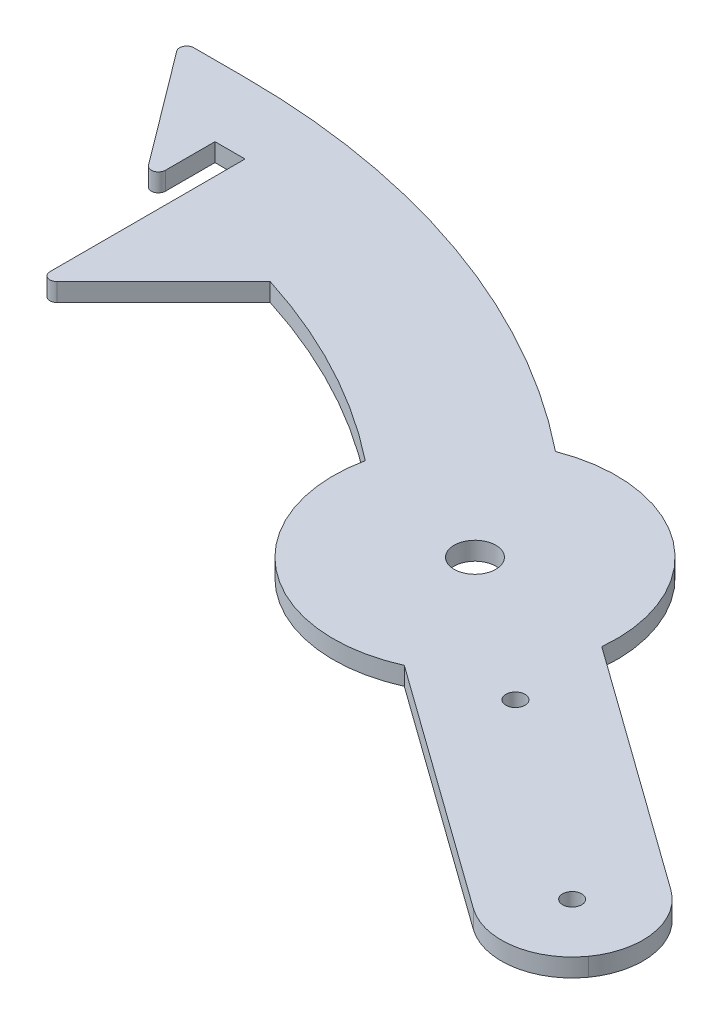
ISO-10303-21;
HEADER;
FILE_DESCRIPTION(('STEP AP214'),'2;1');
FILE_NAME('part.step','',(''),(''),'','','');
FILE_SCHEMA(('AUTOMOTIVE_DESIGN { 1 0 10303 214 1 1 1 1 }'));
ENDSEC;
DATA;
#1=APPLICATION_CONTEXT('core data for automotive mechanical design processes');
#2=APPLICATION_PROTOCOL_DEFINITION('international standard','automotive_design',2000,#1);
#3=PRODUCT_CONTEXT('',#1,'mechanical');
#4=PRODUCT('Part','Part','',(#3));
#5=PRODUCT_RELATED_PRODUCT_CATEGORY('part','',(#4));
#6=PRODUCT_DEFINITION_FORMATION('','',#4);
#7=PRODUCT_DEFINITION_CONTEXT('part definition',#1,'design');
#8=PRODUCT_DEFINITION('design','',#6,#7);
#9=PRODUCT_DEFINITION_SHAPE('','',#8);
#10=(LENGTH_UNIT() NAMED_UNIT(*) SI_UNIT(.MILLI.,.METRE.));
#11=(NAMED_UNIT(*) PLANE_ANGLE_UNIT() SI_UNIT($,.RADIAN.));
#12=(NAMED_UNIT(*) SI_UNIT($,.STERADIAN.) SOLID_ANGLE_UNIT());
#13=UNCERTAINTY_MEASURE_WITH_UNIT(LENGTH_MEASURE(1.E-05),#10,'distance_accuracy_value','');
#14=(GEOMETRIC_REPRESENTATION_CONTEXT(3) GLOBAL_UNCERTAINTY_ASSIGNED_CONTEXT((#13)) GLOBAL_UNIT_ASSIGNED_CONTEXT((#10,
#11,#12)) REPRESENTATION_CONTEXT('',''));
#15=CARTESIAN_POINT('',(0.,0.,0.));
#16=DIRECTION('',(0.,0.,1.));
#17=DIRECTION('',(1.,0.,0.));
#18=AXIS2_PLACEMENT_3D('',#15,#16,#17);
#19=CARTESIAN_POINT('',(-190.915851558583,6.5278,167.770320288));
#20=DIRECTION('',(0.,-1.,0.));
#21=DIRECTION('',(0.,0.,-1.));
#22=AXIS2_PLACEMENT_3D('',#19,#20,#21);
#23=PLANE('',#22);
#24=DIRECTION('',(0.812232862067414,0.,0.583333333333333));
#25=VECTOR('',#24,1.);
#26=CARTESIAN_POINT('',(20.9167793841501,6.5278,46.2939341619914));
#27=LINE('',#26,#25);
#28=CARTESIAN_POINT('',(20.9167793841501,6.5278,46.2939341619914));
#29=VERTEX_POINT('',#28);
#30=CARTESIAN_POINT('',(108.967621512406,6.5278,109.530714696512));
#31=VERTEX_POINT('',#30);
#32=EDGE_CURVE('E187',#29,#31,#27,.T.);
#33=ORIENTED_EDGE('',*,*,#32,.T.);
#34=CARTESIAN_POINT('',(123.784288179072,6.5278,88.8999999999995));
#35=DIRECTION('',(0.,-1.,0.));
#36=DIRECTION('',(0.,0.,-1.));
#37=AXIS2_PLACEMENT_3D('',#34,#35,#36);
#38=CIRCLE('',#37,25.4);
#39=CARTESIAN_POINT('',(144.415002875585,6.5278,103.716666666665));
#40=VERTEX_POINT('',#39);
#41=EDGE_CURVE('E42',#31,#40,#38,.F.);
#42=ORIENTED_EDGE('',*,*,#41,.T.);
#43=CARTESIAN_POINT('',(123.784288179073,6.5278,88.8999999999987));
#44=DIRECTION('',(0.,-1.,0.));
#45=DIRECTION('',(0.,0.,-1.));
#46=AXIS2_PLACEMENT_3D('',#43,#44,#45);
#47=CIRCLE('',#46,25.4);
#48=CARTESIAN_POINT('',(138.60095484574,6.5278,68.2692853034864));
#49=VERTEX_POINT('',#48);
#50=EDGE_CURVE('E49',#40,#49,#47,.F.);
#51=ORIENTED_EDGE('',*,*,#50,.T.);
#52=DIRECTION('',(-0.812232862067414,0.,-0.583333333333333));
#53=VECTOR('',#52,1.);
#54=CARTESIAN_POINT('',(159.231669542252,6.5278,83.0859519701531));
#55=LINE('',#54,#53);
#56=CARTESIAN_POINT('',(50.550112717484,6.5278,5.03250476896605));
#57=VERTEX_POINT('',#56);
#58=EDGE_CURVE('E189',#49,#57,#55,.T.);
#59=ORIENTED_EDGE('',*,*,#58,.T.);
#60=CARTESIAN_POINT('',(0.,6.5278,0.));
#61=DIRECTION('',(0.,1.,0.));
#62=DIRECTION('',(0.,0.,1.));
#63=AXIS2_PLACEMENT_3D('',#60,#61,#62);
#64=CIRCLE('',#63,50.8);
#65=CARTESIAN_POINT('',(-18.4332531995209,6.5278,-47.3376718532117));
#66=VERTEX_POINT('',#65);
#67=EDGE_CURVE('E191',#57,#66,#64,.T.);
#68=ORIENTED_EDGE('',*,*,#67,.T.);
#69=CARTESIAN_POINT('',(-190.915851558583,6.5278,167.770320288));
#70=DIRECTION('',(0.,1.,0.));
#71=DIRECTION('',(0.,0.,-1.));
#72=AXIS2_PLACEMENT_3D('',#69,#70,#71);
#73=CIRCLE('',#72,275.720320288);
#74=CARTESIAN_POINT('',(-190.915851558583,6.5278,-107.95));
#75=VERTEX_POINT('',#74);
#76=EDGE_CURVE('E193',#66,#75,#73,.T.);
#77=ORIENTED_EDGE('',*,*,#76,.T.);
#78=DIRECTION('',(-1.,0.,0.));
#79=VECTOR('',#78,1.);
#80=CARTESIAN_POINT('',(-213.995,6.5278,-107.95));
#81=LINE('',#80,#79);
#82=CARTESIAN_POINT('',(-208.915,6.5278,-107.95));
#83=VERTEX_POINT('',#82);
#84=EDGE_CURVE('E224',#75,#83,#81,.T.);
#85=ORIENTED_EDGE('',*,*,#84,.T.);
#86=CARTESIAN_POINT('',(-208.915,6.5278,-105.41));
#87=DIRECTION('',(0.,-1.,0.));
#88=DIRECTION('',(0.,0.,-1.));
#89=AXIS2_PLACEMENT_3D('',#86,#87,#88);
#90=CIRCLE('',#89,2.54);
#91=CARTESIAN_POINT('',(-210.947,6.5278,-103.886));
#92=VERTEX_POINT('',#91);
#93=EDGE_CURVE('E253',#83,#92,#90,.F.);
#94=ORIENTED_EDGE('',*,*,#93,.T.);
#95=DIRECTION('',(0.6,0.,0.8));
#96=VECTOR('',#95,1.);
#97=CARTESIAN_POINT('',(-213.995,6.5278,-107.95));
#98=LINE('',#97,#96);
#99=CARTESIAN_POINT('',(-180.467,6.5278,-63.246));
#100=VERTEX_POINT('',#99);
#101=EDGE_CURVE('E160',#92,#100,#98,.T.);
#102=ORIENTED_EDGE('',*,*,#101,.T.);
#103=CARTESIAN_POINT('',(-178.435,6.5278,-64.77));
#104=DIRECTION('',(0.,-1.,0.));
#105=DIRECTION('',(0.,0.,-1.));
#106=AXIS2_PLACEMENT_3D('',#103,#104,#105);
#107=CIRCLE('',#106,2.54);
#108=CARTESIAN_POINT('',(-175.895,6.5278,-64.77));
#109=VERTEX_POINT('',#108);
#110=EDGE_CURVE('E156',#100,#109,#107,.F.);
#111=ORIENTED_EDGE('',*,*,#110,.T.);
#112=DIRECTION('',(0.,0.,-1.));
#113=VECTOR('',#112,1.);
#114=CARTESIAN_POINT('',(-175.895,6.5278,-82.55));
#115=LINE('',#114,#113);
#116=CARTESIAN_POINT('',(-175.895,6.5278,-82.55));
#117=VERTEX_POINT('',#116);
#118=EDGE_CURVE('E147',#109,#117,#115,.T.);
#119=ORIENTED_EDGE('',*,*,#118,.T.);
#120=DIRECTION('',(1.,0.,0.));
#121=VECTOR('',#120,1.);
#122=CARTESIAN_POINT('',(-175.895,6.5278,-82.55));
#123=LINE('',#122,#121);
#124=CARTESIAN_POINT('',(-165.1,6.5278,-82.55));
#125=VERTEX_POINT('',#124);
#126=EDGE_CURVE('E152',#117,#125,#123,.T.);
#127=ORIENTED_EDGE('',*,*,#126,.T.);
#128=DIRECTION('',(0.,0.,1.));
#129=VECTOR('',#128,1.);
#130=CARTESIAN_POINT('',(-165.1,6.5278,-82.55));
#131=LINE('',#130,#129);
#132=CARTESIAN_POINT('',(-165.1,6.5278,-12.4821024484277));
#133=VERTEX_POINT('',#132);
#134=EDGE_CURVE('E176',#125,#133,#131,.T.);
#135=ORIENTED_EDGE('',*,*,#134,.T.);
#136=CARTESIAN_POINT('',(-162.56,6.5278,-12.4821024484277));
#137=DIRECTION('',(0.,-1.,0.));
#138=DIRECTION('',(0.,0.,-1.));
#139=AXIS2_PLACEMENT_3D('',#136,#137,#138);
#140=CIRCLE('',#139,2.54);
#141=CARTESIAN_POINT('',(-160.763948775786,6.5278,-10.6860512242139));
#142=VERTEX_POINT('',#141);
#143=EDGE_CURVE('E256',#133,#142,#140,.F.);
#144=ORIENTED_EDGE('',*,*,#143,.T.);
#145=DIRECTION('',(0.707106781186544,0.,-0.707106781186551));
#146=VECTOR('',#145,1.);
#147=CARTESIAN_POINT('',(-165.1,6.5278,-6.35));
#148=LINE('',#147,#146);
#149=CARTESIAN_POINT('',(-122.482338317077,6.5278,-48.9676616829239));
#150=VERTEX_POINT('',#149);
#151=EDGE_CURVE('E178',#142,#150,#148,.T.);
#152=ORIENTED_EDGE('',*,*,#151,.T.);
#153=CARTESIAN_POINT('',(-190.915851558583,6.5278,167.770320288));
#154=DIRECTION('',(0.,-1.,0.));
#155=DIRECTION('',(0.,0.,-1.));
#156=AXIS2_PLACEMENT_3D('',#153,#154,#155);
#157=CIRCLE('',#156,227.285060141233);
#158=CARTESIAN_POINT('',(-49.734736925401,6.5278,-10.3487169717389));
#159=VERTEX_POINT('',#158);
#160=EDGE_CURVE('E183',#150,#159,#157,.T.);
#161=ORIENTED_EDGE('',*,*,#160,.T.);
#162=CARTESIAN_POINT('',(0.,6.5278,0.));
#163=DIRECTION('',(0.,1.,0.));
#164=DIRECTION('',(0.,0.,1.));
#165=AXIS2_PLACEMENT_3D('',#162,#163,#164);
#166=CIRCLE('',#165,50.8);
#167=EDGE_CURVE('E185',#159,#29,#166,.T.);
#168=ORIENTED_EDGE('',*,*,#167,.T.);
#169=EDGE_LOOP('',(#33,#42,#51,#59,#68,#77,#85,#94,#102,#111,#119,#127,#135,#144,#152,#161,#168));
#170=FACE_BOUND('',#169,.T.);
#171=CARTESIAN_POINT('',(0.,6.5278,0.));
#172=DIRECTION('',(0.,1.,0.));
#173=DIRECTION('',(0.,0.,1.));
#174=AXIS2_PLACEMENT_3D('',#171,#172,#173);
#175=CIRCLE('',#174,7.493);
#176=CARTESIAN_POINT('',(0.,6.5278,-7.493));
#177=VERTEX_POINT('',#176);
#178=EDGE_CURVE('E200',#177,#177,#175,.T.);
#179=ORIENTED_EDGE('',*,*,#178,.F.);
#180=EDGE_LOOP('',(#179));
#181=FACE_BOUND('',#180,.T.);
#182=CARTESIAN_POINT('',(123.784288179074,6.5278,88.9));
#183=DIRECTION('',(0.,1.,0.));
#184=DIRECTION('',(0.,0.,1.));
#185=AXIS2_PLACEMENT_3D('',#182,#183,#184);
#186=CIRCLE('',#185,3.42899999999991);
#187=CARTESIAN_POINT('',(123.784288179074,6.5278,85.4710000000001));
#188=VERTEX_POINT('',#187);
#189=EDGE_CURVE('E309',#188,#188,#186,.T.);
#190=ORIENTED_EDGE('',*,*,#189,.F.);
#191=EDGE_LOOP('',(#190));
#192=FACE_BOUND('',#191,.T.);
#193=CARTESIAN_POINT('',(51.5767867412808,6.5278,37.0416666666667));
#194=DIRECTION('',(0.,1.,0.));
#195=DIRECTION('',(0.,0.,1.));
#196=AXIS2_PLACEMENT_3D('',#193,#194,#195);
#197=CIRCLE('',#196,3.42899999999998);
#198=CARTESIAN_POINT('',(51.5767867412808,6.5278,33.6126666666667));
#199=VERTEX_POINT('',#198);
#200=EDGE_CURVE('E301',#199,#199,#197,.T.);
#201=ORIENTED_EDGE('',*,*,#200,.F.);
#202=EDGE_LOOP('',(#201));
#203=FACE_BOUND('',#202,.T.);
#204=ADVANCED_FACE('F33',(#170,#181,#192,#203),#23,.F.);
#205=CARTESIAN_POINT('',(-190.915851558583,0.,167.770320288));
#206=DIRECTION('',(0.,-1.,0.));
#207=DIRECTION('',(0.,0.,-1.));
#208=AXIS2_PLACEMENT_3D('',#205,#206,#207);
#209=PLANE('',#208);
#210=CARTESIAN_POINT('',(123.784288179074,0.,88.9));
#211=DIRECTION('',(0.,1.,0.));
#212=DIRECTION('',(0.,0.,1.));
#213=AXIS2_PLACEMENT_3D('',#210,#211,#212);
#214=CIRCLE('',#213,3.42899999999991);
#215=CARTESIAN_POINT('',(123.784288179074,0.,85.4710000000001));
#216=VERTEX_POINT('',#215);
#217=EDGE_CURVE('E306',#216,#216,#214,.T.);
#218=ORIENTED_EDGE('',*,*,#217,.T.);
#219=EDGE_LOOP('',(#218));
#220=FACE_BOUND('',#219,.T.);
#221=CARTESIAN_POINT('',(123.784288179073,0.,88.8999999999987));
#222=DIRECTION('',(0.,-1.,0.));
#223=DIRECTION('',(0.,0.,-1.));
#224=AXIS2_PLACEMENT_3D('',#221,#222,#223);
#225=CIRCLE('',#224,25.4);
#226=CARTESIAN_POINT('',(138.60095484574,0.,68.2692853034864));
#227=VERTEX_POINT('',#226);
#228=CARTESIAN_POINT('',(144.415002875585,0.,103.716666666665));
#229=VERTEX_POINT('',#228);
#230=EDGE_CURVE('E267',#227,#229,#225,.T.);
#231=ORIENTED_EDGE('',*,*,#230,.T.);
#232=CARTESIAN_POINT('',(123.784288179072,0.,88.8999999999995));
#233=DIRECTION('',(0.,-1.,0.));
#234=DIRECTION('',(0.,0.,-1.));
#235=AXIS2_PLACEMENT_3D('',#232,#233,#234);
#236=CIRCLE('',#235,25.4);
#237=CARTESIAN_POINT('',(108.967621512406,0.,109.530714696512));
#238=VERTEX_POINT('',#237);
#239=EDGE_CURVE('E269',#229,#238,#236,.T.);
#240=ORIENTED_EDGE('',*,*,#239,.T.);
#241=DIRECTION('',(0.812232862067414,0.,0.583333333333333));
#242=VECTOR('',#241,1.);
#243=CARTESIAN_POINT('',(20.9167793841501,0.,46.2939341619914));
#244=LINE('',#243,#242);
#245=CARTESIAN_POINT('',(20.9167793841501,0.,46.2939341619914));
#246=VERTEX_POINT('',#245);
#247=EDGE_CURVE('E215',#246,#238,#244,.T.);
#248=ORIENTED_EDGE('',*,*,#247,.F.);
#249=CARTESIAN_POINT('',(0.,0.,0.));
#250=DIRECTION('',(0.,1.,0.));
#251=DIRECTION('',(0.,0.,1.));
#252=AXIS2_PLACEMENT_3D('',#249,#250,#251);
#253=CIRCLE('',#252,50.8);
#254=CARTESIAN_POINT('',(-49.734736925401,0.,-10.3487169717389));
#255=VERTEX_POINT('',#254);
#256=EDGE_CURVE('E213',#255,#246,#253,.T.);
#257=ORIENTED_EDGE('',*,*,#256,.F.);
#258=CARTESIAN_POINT('',(-190.915851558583,0.,167.770320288));
#259=DIRECTION('',(0.,-1.,0.));
#260=DIRECTION('',(0.,0.,-1.));
#261=AXIS2_PLACEMENT_3D('',#258,#259,#260);
#262=CIRCLE('',#261,227.285060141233);
#263=CARTESIAN_POINT('',(-122.482338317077,0.,-48.9676616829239));
#264=VERTEX_POINT('',#263);
#265=EDGE_CURVE('E211',#264,#255,#262,.T.);
#266=ORIENTED_EDGE('',*,*,#265,.F.);
#267=DIRECTION('',(0.707106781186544,0.,-0.707106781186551));
#268=VECTOR('',#267,1.);
#269=CARTESIAN_POINT('',(-165.1,0.,-6.35));
#270=LINE('',#269,#268);
#271=CARTESIAN_POINT('',(-160.763948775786,0.,-10.6860512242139));
#272=VERTEX_POINT('',#271);
#273=EDGE_CURVE('E209',#272,#264,#270,.T.);
#274=ORIENTED_EDGE('',*,*,#273,.F.);
#275=CARTESIAN_POINT('',(-162.56,0.,-12.4821024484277));
#276=DIRECTION('',(0.,-1.,0.));
#277=DIRECTION('',(0.,0.,-1.));
#278=AXIS2_PLACEMENT_3D('',#275,#276,#277);
#279=CIRCLE('',#278,2.54);
#280=CARTESIAN_POINT('',(-165.1,0.,-12.4821024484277));
#281=VERTEX_POINT('',#280);
#282=EDGE_CURVE('E249',#272,#281,#279,.T.);
#283=ORIENTED_EDGE('',*,*,#282,.T.);
#284=DIRECTION('',(0.,0.,1.));
#285=VECTOR('',#284,1.);
#286=CARTESIAN_POINT('',(-165.1,0.,-48.9676616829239));
#287=LINE('',#286,#285);
#288=CARTESIAN_POINT('',(-165.1,0.,-82.55));
#289=VERTEX_POINT('',#288);
#290=EDGE_CURVE('E206',#289,#281,#287,.T.);
#291=ORIENTED_EDGE('',*,*,#290,.F.);
#292=DIRECTION('',(1.,0.,0.));
#293=VECTOR('',#292,1.);
#294=CARTESIAN_POINT('',(-175.895,0.,-82.55));
#295=LINE('',#294,#293);
#296=CARTESIAN_POINT('',(-175.895,0.,-82.55));
#297=VERTEX_POINT('',#296);
#298=EDGE_CURVE('E204',#297,#289,#295,.T.);
#299=ORIENTED_EDGE('',*,*,#298,.F.);
#300=DIRECTION('',(0.,0.,-1.));
#301=VECTOR('',#300,1.);
#302=CARTESIAN_POINT('',(-175.895,0.,-82.55));
#303=LINE('',#302,#301);
#304=CARTESIAN_POINT('',(-175.895,0.,-64.77));
#305=VERTEX_POINT('',#304);
#306=EDGE_CURVE('E166',#305,#297,#303,.T.);
#307=ORIENTED_EDGE('',*,*,#306,.F.);
#308=CARTESIAN_POINT('',(-178.435,0.,-64.77));
#309=DIRECTION('',(0.,-1.,0.));
#310=DIRECTION('',(0.,0.,-1.));
#311=AXIS2_PLACEMENT_3D('',#308,#309,#310);
#312=CIRCLE('',#311,2.54);
#313=CARTESIAN_POINT('',(-180.467,0.,-63.246));
#314=VERTEX_POINT('',#313);
#315=EDGE_CURVE('E247',#305,#314,#312,.T.);
#316=ORIENTED_EDGE('',*,*,#315,.T.);
#317=DIRECTION('',(0.6,0.,0.8));
#318=VECTOR('',#317,1.);
#319=CARTESIAN_POINT('',(-213.995,0.,-107.95));
#320=LINE('',#319,#318);
#321=CARTESIAN_POINT('',(-210.947,0.,-103.886));
#322=VERTEX_POINT('',#321);
#323=EDGE_CURVE('E199',#322,#314,#320,.T.);
#324=ORIENTED_EDGE('',*,*,#323,.F.);
#325=CARTESIAN_POINT('',(-208.915,0.,-105.41));
#326=DIRECTION('',(0.,-1.,0.));
#327=DIRECTION('',(0.,0.,-1.));
#328=AXIS2_PLACEMENT_3D('',#325,#326,#327);
#329=CIRCLE('',#328,2.54);
#330=CARTESIAN_POINT('',(-208.915,0.,-107.95));
#331=VERTEX_POINT('',#330);
#332=EDGE_CURVE('E245',#322,#331,#329,.T.);
#333=ORIENTED_EDGE('',*,*,#332,.T.);
#334=DIRECTION('',(-1.,0.,0.));
#335=VECTOR('',#334,1.);
#336=CARTESIAN_POINT('',(-213.995,0.,-107.95));
#337=LINE('',#336,#335);
#338=CARTESIAN_POINT('',(-190.915851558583,0.,-107.95));
#339=VERTEX_POINT('',#338);
#340=EDGE_CURVE('E196',#339,#331,#337,.T.);
#341=ORIENTED_EDGE('',*,*,#340,.F.);
#342=CARTESIAN_POINT('',(-190.915851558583,0.,167.770320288));
#343=DIRECTION('',(0.,1.,0.));
#344=DIRECTION('',(0.,0.,-1.));
#345=AXIS2_PLACEMENT_3D('',#342,#343,#344);
#346=CIRCLE('',#345,275.720320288);
#347=CARTESIAN_POINT('',(-18.4332531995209,0.,-47.3376718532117));
#348=VERTEX_POINT('',#347);
#349=EDGE_CURVE('E222',#348,#339,#346,.T.);
#350=ORIENTED_EDGE('',*,*,#349,.F.);
#351=CARTESIAN_POINT('',(0.,0.,0.));
#352=DIRECTION('',(0.,1.,0.));
#353=DIRECTION('',(0.,0.,1.));
#354=AXIS2_PLACEMENT_3D('',#351,#352,#353);
#355=CIRCLE('',#354,50.8);
#356=CARTESIAN_POINT('',(50.550112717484,0.,5.03250476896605));
#357=VERTEX_POINT('',#356);
#358=EDGE_CURVE('E220',#357,#348,#355,.T.);
#359=ORIENTED_EDGE('',*,*,#358,.F.);
#360=DIRECTION('',(-0.812232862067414,0.,-0.583333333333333));
#361=VECTOR('',#360,1.);
#362=CARTESIAN_POINT('',(159.231669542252,0.,83.0859519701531));
#363=LINE('',#362,#361);
#364=EDGE_CURVE('E218',#227,#357,#363,.T.);
#365=ORIENTED_EDGE('',*,*,#364,.F.);
#366=EDGE_LOOP('',(#231,#240,#248,#257,#266,#274,#283,#291,#299,#307,#316,#324,#333,#341,#350,
#359,#365));
#367=FACE_BOUND('',#366,.T.);
#368=CARTESIAN_POINT('',(0.,0.,0.));
#369=DIRECTION('',(0.,1.,0.));
#370=DIRECTION('',(0.,0.,1.));
#371=AXIS2_PLACEMENT_3D('',#368,#369,#370);
#372=CIRCLE('',#371,7.493);
#373=CARTESIAN_POINT('',(0.,0.,-7.493));
#374=VERTEX_POINT('',#373);
#375=EDGE_CURVE('E312',#374,#374,#372,.T.);
#376=ORIENTED_EDGE('',*,*,#375,.T.);
#377=EDGE_LOOP('',(#376));
#378=FACE_BOUND('',#377,.T.);
#379=CARTESIAN_POINT('',(51.5767867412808,0.,37.0416666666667));
#380=DIRECTION('',(0.,1.,0.));
#381=DIRECTION('',(0.,0.,1.));
#382=AXIS2_PLACEMENT_3D('',#379,#380,#381);
#383=CIRCLE('',#382,3.42899999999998);
#384=CARTESIAN_POINT('',(51.5767867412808,0.,33.6126666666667));
#385=VERTEX_POINT('',#384);
#386=EDGE_CURVE('E299',#385,#385,#383,.T.);
#387=ORIENTED_EDGE('',*,*,#386,.T.);
#388=EDGE_LOOP('',(#387));
#389=FACE_BOUND('',#388,.T.);
#390=ADVANCED_FACE('F290',(#220,#367,#378,#389),#209,.T.);
#391=CARTESIAN_POINT('',(-213.995,6.5278,-107.95));
#392=DIRECTION('',(0.,0.,1.));
#393=DIRECTION('',(1.,0.,0.));
#394=AXIS2_PLACEMENT_3D('',#391,#392,#393);
#395=PLANE('',#394);
#396=ORIENTED_EDGE('',*,*,#340,.T.);
#397=DIRECTION('',(0.,-1.,0.));
#398=VECTOR('',#397,1.);
#399=CARTESIAN_POINT('',(-208.915,6.5278,-107.95));
#400=LINE('',#399,#398);
#401=EDGE_CURVE('E265',#331,#83,#400,.F.);
#402=ORIENTED_EDGE('',*,*,#401,.T.);
#403=ORIENTED_EDGE('',*,*,#84,.F.);
#404=DIRECTION('',(0.,-1.,0.));
#405=VECTOR('',#404,1.);
#406=CARTESIAN_POINT('',(-190.915851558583,6.5278,-107.95));
#407=LINE('',#406,#405);
#408=EDGE_CURVE('E195',#75,#339,#407,.T.);
#409=ORIENTED_EDGE('',*,*,#408,.T.);
#410=EDGE_LOOP('',(#396,#402,#403,#409));
#411=FACE_BOUND('',#410,.T.);
#412=ADVANCED_FACE('F355',(#411),#395,.F.);
#413=CARTESIAN_POINT('',(-213.995,6.5278,-107.95));
#414=DIRECTION('',(0.8,0.,-0.6));
#415=DIRECTION('',(-0.6,0.,-0.8));
#416=AXIS2_PLACEMENT_3D('',#413,#414,#415);
#417=PLANE('',#416);
#418=ORIENTED_EDGE('',*,*,#323,.T.);
#419=DIRECTION('',(0.,-1.,0.));
#420=VECTOR('',#419,1.);
#421=CARTESIAN_POINT('',(-180.467,6.5278,-63.246));
#422=LINE('',#421,#420);
#423=EDGE_CURVE('E263',#314,#100,#422,.F.);
#424=ORIENTED_EDGE('',*,*,#423,.T.);
#425=ORIENTED_EDGE('',*,*,#101,.F.);
#426=DIRECTION('',(0.,-1.,0.));
#427=VECTOR('',#426,1.);
#428=CARTESIAN_POINT('',(-210.947,6.5278,-103.886));
#429=LINE('',#428,#427);
#430=EDGE_CURVE('E260',#92,#322,#429,.T.);
#431=ORIENTED_EDGE('',*,*,#430,.T.);
#432=EDGE_LOOP('',(#418,#424,#425,#431));
#433=FACE_BOUND('',#432,.T.);
#434=ADVANCED_FACE('F502',(#433),#417,.F.);
#435=CARTESIAN_POINT('',(-175.895,6.5278,-82.55));
#436=DIRECTION('',(-1.,0.,0.));
#437=DIRECTION('',(0.,0.,1.));
#438=AXIS2_PLACEMENT_3D('',#435,#436,#437);
#439=PLANE('',#438);
#440=ORIENTED_EDGE('',*,*,#118,.F.);
#441=DIRECTION('',(0.,-1.,0.));
#442=VECTOR('',#441,1.);
#443=CARTESIAN_POINT('',(-175.895,6.5278,-64.77));
#444=LINE('',#443,#442);
#445=EDGE_CURVE('E258',#109,#305,#444,.T.);
#446=ORIENTED_EDGE('',*,*,#445,.T.);
#447=ORIENTED_EDGE('',*,*,#306,.T.);
#448=DIRECTION('',(0.,-1.,0.));
#449=VECTOR('',#448,1.);
#450=CARTESIAN_POINT('',(-175.895,6.5278,-82.55));
#451=LINE('',#450,#449);
#452=EDGE_CURVE('E163',#117,#297,#451,.T.);
#453=ORIENTED_EDGE('',*,*,#452,.F.);
#454=EDGE_LOOP('',(#440,#446,#447,#453));
#455=FACE_BOUND('',#454,.T.);
#456=ADVANCED_FACE('F164',(#455),#439,.F.);
#457=CARTESIAN_POINT('',(-175.895,6.5278,-82.55));
#458=DIRECTION('',(0.,0.,-1.));
#459=DIRECTION('',(-1.,0.,0.));
#460=AXIS2_PLACEMENT_3D('',#457,#458,#459);
#461=PLANE('',#460);
#462=ORIENTED_EDGE('',*,*,#298,.T.);
#463=DIRECTION('',(0.,-1.,0.));
#464=VECTOR('',#463,1.);
#465=CARTESIAN_POINT('',(-165.1,6.5278,-82.55));
#466=LINE('',#465,#464);
#467=EDGE_CURVE('E171',#125,#289,#466,.T.);
#468=ORIENTED_EDGE('',*,*,#467,.F.);
#469=ORIENTED_EDGE('',*,*,#126,.F.);
#470=ORIENTED_EDGE('',*,*,#452,.T.);
#471=EDGE_LOOP('',(#462,#468,#469,#470));
#472=FACE_BOUND('',#471,.T.);
#473=ADVANCED_FACE('F173',(#472),#461,.F.);
#474=CARTESIAN_POINT('',(-165.1,6.5278,-48.9676616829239));
#475=DIRECTION('',(1.,0.,0.));
#476=DIRECTION('',(0.,0.,-1.));
#477=AXIS2_PLACEMENT_3D('',#474,#475,#476);
#478=PLANE('',#477);
#479=ORIENTED_EDGE('',*,*,#290,.T.);
#480=DIRECTION('',(0.,-1.,0.));
#481=VECTOR('',#480,1.);
#482=CARTESIAN_POINT('',(-165.1,6.5278,-12.4821024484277));
#483=LINE('',#482,#481);
#484=EDGE_CURVE('E251',#281,#133,#483,.F.);
#485=ORIENTED_EDGE('',*,*,#484,.T.);
#486=ORIENTED_EDGE('',*,*,#134,.F.);
#487=ORIENTED_EDGE('',*,*,#467,.T.);
#488=EDGE_LOOP('',(#479,#485,#486,#487));
#489=FACE_BOUND('',#488,.T.);
#490=ADVANCED_FACE('F329',(#489),#478,.F.);
#491=CARTESIAN_POINT('',(-165.1,6.5278,-6.35));
#492=DIRECTION('',(-0.707106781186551,0.,-0.707106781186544));
#493=DIRECTION('',(-0.707106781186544,0.,0.707106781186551));
#494=AXIS2_PLACEMENT_3D('',#491,#492,#493);
#495=PLANE('',#494);
#496=ORIENTED_EDGE('',*,*,#151,.F.);
#497=DIRECTION('',(0.,-1.,0.));
#498=VECTOR('',#497,1.);
#499=CARTESIAN_POINT('',(-160.763948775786,6.5278,-10.6860512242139));
#500=LINE('',#499,#498);
#501=EDGE_CURVE('E170',#142,#272,#500,.T.);
#502=ORIENTED_EDGE('',*,*,#501,.T.);
#503=ORIENTED_EDGE('',*,*,#273,.T.);
#504=DIRECTION('',(0.,-1.,0.));
#505=VECTOR('',#504,1.);
#506=CARTESIAN_POINT('',(-122.482338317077,6.5278,-48.9676616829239));
#507=LINE('',#506,#505);
#508=EDGE_CURVE('E239',#150,#264,#507,.T.);
#509=ORIENTED_EDGE('',*,*,#508,.F.);
#510=EDGE_LOOP('',(#496,#502,#503,#509));
#511=FACE_BOUND('',#510,.T.);
#512=ADVANCED_FACE('F338',(#511),#495,.F.);
#513=CARTESIAN_POINT('',(-190.915851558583,6.5278,167.770320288));
#514=DIRECTION('',(0.,-1.,0.));
#515=DIRECTION('',(0.,0.,-1.));
#516=AXIS2_PLACEMENT_3D('',#513,#514,#515);
#517=CYLINDRICAL_SURFACE('',#516,227.285060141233);
#518=ORIENTED_EDGE('',*,*,#265,.T.);
#519=DIRECTION('',(0.,-1.,0.));
#520=VECTOR('',#519,1.);
#521=CARTESIAN_POINT('',(-49.734736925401,6.5278,-10.3487169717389));
#522=LINE('',#521,#520);
#523=EDGE_CURVE('E236',#159,#255,#522,.T.);
#524=ORIENTED_EDGE('',*,*,#523,.F.);
#525=ORIENTED_EDGE('',*,*,#160,.F.);
#526=ORIENTED_EDGE('',*,*,#508,.T.);
#527=EDGE_LOOP('',(#518,#524,#525,#526));
#528=FACE_BOUND('',#527,.T.);
#529=ADVANCED_FACE('F341',(#528),#517,.F.);
#530=CARTESIAN_POINT('',(0.,6.5278,0.));
#531=DIRECTION('',(0.,-1.,0.));
#532=DIRECTION('',(0.,0.,-1.));
#533=AXIS2_PLACEMENT_3D('',#530,#531,#532);
#534=CYLINDRICAL_SURFACE('',#533,50.8);
#535=ORIENTED_EDGE('',*,*,#256,.T.);
#536=DIRECTION('',(0.,-1.,0.));
#537=VECTOR('',#536,1.);
#538=CARTESIAN_POINT('',(20.9167793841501,6.5278,46.2939341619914));
#539=LINE('',#538,#537);
#540=EDGE_CURVE('E233',#29,#246,#539,.T.);
#541=ORIENTED_EDGE('',*,*,#540,.F.);
#542=ORIENTED_EDGE('',*,*,#167,.F.);
#543=ORIENTED_EDGE('',*,*,#523,.T.);
#544=EDGE_LOOP('',(#535,#541,#542,#543));
#545=FACE_BOUND('',#544,.T.);
#546=ADVANCED_FACE('F287',(#545),#534,.T.);
#547=CARTESIAN_POINT('',(20.9167793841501,6.5278,46.2939341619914));
#548=DIRECTION('',(0.583333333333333,0.,-0.812232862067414));
#549=DIRECTION('',(-0.812232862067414,0.,-0.583333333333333));
#550=AXIS2_PLACEMENT_3D('',#547,#548,#549);
#551=PLANE('',#550);
#552=ORIENTED_EDGE('',*,*,#247,.T.);
#553=DIRECTION('',(0.,-1.,0.));
#554=VECTOR('',#553,1.);
#555=CARTESIAN_POINT('',(108.967621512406,6.5278,109.530714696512));
#556=LINE('',#555,#554);
#557=EDGE_CURVE('E271',#238,#31,#556,.F.);
#558=ORIENTED_EDGE('',*,*,#557,.T.);
#559=ORIENTED_EDGE('',*,*,#32,.F.);
#560=ORIENTED_EDGE('',*,*,#540,.T.);
#561=EDGE_LOOP('',(#552,#558,#559,#560));
#562=FACE_BOUND('',#561,.T.);
#563=ADVANCED_FACE('F278',(#562),#551,.F.);
#564=CARTESIAN_POINT('',(159.231669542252,6.5278,83.0859519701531));
#565=DIRECTION('',(-0.583333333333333,0.,0.812232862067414));
#566=DIRECTION('',(0.812232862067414,0.,0.583333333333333));
#567=AXIS2_PLACEMENT_3D('',#564,#565,#566);
#568=PLANE('',#567);
#569=ORIENTED_EDGE('',*,*,#58,.F.);
#570=DIRECTION('',(0.,-1.,0.));
#571=VECTOR('',#570,1.);
#572=CARTESIAN_POINT('',(138.60095484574,6.5278,68.2692853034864));
#573=LINE('',#572,#571);
#574=EDGE_CURVE('E11',#49,#227,#573,.T.);
#575=ORIENTED_EDGE('',*,*,#574,.T.);
#576=ORIENTED_EDGE('',*,*,#364,.T.);
#577=DIRECTION('',(0.,-1.,0.));
#578=VECTOR('',#577,1.);
#579=CARTESIAN_POINT('',(50.550112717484,6.5278,5.03250476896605));
#580=LINE('',#579,#578);
#581=EDGE_CURVE('E230',#57,#357,#580,.T.);
#582=ORIENTED_EDGE('',*,*,#581,.F.);
#583=EDGE_LOOP('',(#569,#575,#576,#582));
#584=FACE_BOUND('',#583,.T.);
#585=ADVANCED_FACE('F369',(#584),#568,.F.);
#586=CARTESIAN_POINT('',(0.,6.5278,0.));
#587=DIRECTION('',(0.,-1.,0.));
#588=DIRECTION('',(0.,0.,-1.));
#589=AXIS2_PLACEMENT_3D('',#586,#587,#588);
#590=CYLINDRICAL_SURFACE('',#589,50.8);
#591=ORIENTED_EDGE('',*,*,#358,.T.);
#592=DIRECTION('',(0.,-1.,0.));
#593=VECTOR('',#592,1.);
#594=CARTESIAN_POINT('',(-18.4332531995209,6.5278,-47.3376718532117));
#595=LINE('',#594,#593);
#596=EDGE_CURVE('E227',#66,#348,#595,.T.);
#597=ORIENTED_EDGE('',*,*,#596,.F.);
#598=ORIENTED_EDGE('',*,*,#67,.F.);
#599=ORIENTED_EDGE('',*,*,#581,.T.);
#600=EDGE_LOOP('',(#591,#597,#598,#599));
#601=FACE_BOUND('',#600,.T.);
#602=ADVANCED_FACE('F365',(#601),#590,.T.);
#603=CARTESIAN_POINT('',(-190.915851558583,6.5278,167.770320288));
#604=DIRECTION('',(0.,-1.,0.));
#605=DIRECTION('',(0.,0.,-1.));
#606=AXIS2_PLACEMENT_3D('',#603,#604,#605);
#607=CYLINDRICAL_SURFACE('',#606,275.720320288);
#608=ORIENTED_EDGE('',*,*,#349,.T.);
#609=ORIENTED_EDGE('',*,*,#408,.F.);
#610=ORIENTED_EDGE('',*,*,#76,.F.);
#611=ORIENTED_EDGE('',*,*,#596,.T.);
#612=EDGE_LOOP('',(#608,#609,#610,#611));
#613=FACE_BOUND('',#612,.T.);
#614=ADVANCED_FACE('F362',(#613),#607,.T.);
#615=CARTESIAN_POINT('',(0.,6.5278,0.));
#616=DIRECTION('',(0.,-1.,0.));
#617=DIRECTION('',(0.,0.,-1.));
#618=AXIS2_PLACEMENT_3D('',#615,#616,#617);
#619=CYLINDRICAL_SURFACE('',#618,7.493);
#620=CARTESIAN_POINT('',(0.,6.5278,-7.493));
#621=CARTESIAN_POINT('',(0.,6.45980208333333,-7.493));
#622=CARTESIAN_POINT('',(0.,6.39180416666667,-7.493));
#623=CARTESIAN_POINT('',(0.,6.25580833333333,-7.493));
#624=CARTESIAN_POINT('',(0.,6.18781041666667,-7.493));
#625=CARTESIAN_POINT('',(0.,6.05181458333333,-7.493));
#626=CARTESIAN_POINT('',(0.,5.98381666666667,-7.493));
#627=CARTESIAN_POINT('',(0.,5.84782083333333,-7.493));
#628=CARTESIAN_POINT('',(0.,5.77982291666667,-7.493));
#629=CARTESIAN_POINT('',(0.,5.64382708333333,-7.493));
#630=CARTESIAN_POINT('',(0.,5.57582916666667,-7.493));
#631=CARTESIAN_POINT('',(0.,5.43983333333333,-7.493));
#632=CARTESIAN_POINT('',(0.,5.37183541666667,-7.493));
#633=CARTESIAN_POINT('',(0.,5.23583958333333,-7.493));
#634=CARTESIAN_POINT('',(0.,5.16784166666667,-7.493));
#635=CARTESIAN_POINT('',(0.,5.03184583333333,-7.493));
#636=CARTESIAN_POINT('',(0.,4.96384791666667,-7.493));
#637=CARTESIAN_POINT('',(0.,4.82785208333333,-7.493));
#638=CARTESIAN_POINT('',(0.,4.75985416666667,-7.493));
#639=CARTESIAN_POINT('',(0.,4.62385833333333,-7.493));
#640=CARTESIAN_POINT('',(0.,4.55586041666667,-7.493));
#641=CARTESIAN_POINT('',(0.,4.41986458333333,-7.493));
#642=CARTESIAN_POINT('',(0.,4.35186666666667,-7.493));
#643=CARTESIAN_POINT('',(0.,4.21587083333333,-7.493));
#644=CARTESIAN_POINT('',(0.,4.14787291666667,-7.493));
#645=CARTESIAN_POINT('',(0.,4.01187708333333,-7.493));
#646=CARTESIAN_POINT('',(0.,3.94387916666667,-7.493));
#647=CARTESIAN_POINT('',(0.,3.80788333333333,-7.493));
#648=CARTESIAN_POINT('',(0.,3.73988541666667,-7.493));
#649=CARTESIAN_POINT('',(0.,3.60388958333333,-7.493));
#650=CARTESIAN_POINT('',(0.,3.53589166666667,-7.493));
#651=CARTESIAN_POINT('',(0.,3.39989583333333,-7.493));
#652=CARTESIAN_POINT('',(0.,3.33189791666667,-7.493));
#653=CARTESIAN_POINT('',(0.,3.19590208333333,-7.493));
#654=CARTESIAN_POINT('',(0.,3.12790416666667,-7.493));
#655=CARTESIAN_POINT('',(0.,2.99190833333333,-7.493));
#656=CARTESIAN_POINT('',(0.,2.92391041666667,-7.493));
#657=CARTESIAN_POINT('',(0.,2.78791458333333,-7.493));
#658=CARTESIAN_POINT('',(0.,2.71991666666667,-7.493));
#659=CARTESIAN_POINT('',(0.,2.58392083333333,-7.493));
#660=CARTESIAN_POINT('',(0.,2.51592291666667,-7.493));
#661=CARTESIAN_POINT('',(0.,2.37992708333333,-7.493));
#662=CARTESIAN_POINT('',(0.,2.31192916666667,-7.493));
#663=CARTESIAN_POINT('',(0.,2.17593333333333,-7.493));
#664=CARTESIAN_POINT('',(0.,2.10793541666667,-7.493));
#665=CARTESIAN_POINT('',(0.,1.97193958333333,-7.493));
#666=CARTESIAN_POINT('',(0.,1.90394166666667,-7.493));
#667=CARTESIAN_POINT('',(0.,1.76794583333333,-7.493));
#668=CARTESIAN_POINT('',(0.,1.69994791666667,-7.493));
#669=CARTESIAN_POINT('',(0.,1.56395208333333,-7.493));
#670=CARTESIAN_POINT('',(0.,1.49595416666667,-7.493));
#671=CARTESIAN_POINT('',(0.,1.35995833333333,-7.493));
#672=CARTESIAN_POINT('',(0.,1.29196041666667,-7.493));
#673=CARTESIAN_POINT('',(0.,1.15596458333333,-7.493));
#674=CARTESIAN_POINT('',(0.,1.08796666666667,-7.493));
#675=CARTESIAN_POINT('',(0.,0.951970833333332,-7.493));
#676=CARTESIAN_POINT('',(0.,0.883972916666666,-7.493));
#677=CARTESIAN_POINT('',(0.,0.747977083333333,-7.493));
#678=CARTESIAN_POINT('',(0.,0.679979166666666,-7.493));
#679=CARTESIAN_POINT('',(0.,0.543983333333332,-7.493));
#680=CARTESIAN_POINT('',(0.,0.475985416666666,-7.493));
#681=CARTESIAN_POINT('',(0.,0.339989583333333,-7.493));
#682=CARTESIAN_POINT('',(0.,0.271991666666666,-7.493));
#683=CARTESIAN_POINT('',(0.,0.135995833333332,-7.493));
#684=CARTESIAN_POINT('',(0.,0.0679979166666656,-7.493));
#685=CARTESIAN_POINT('',(0.,0.,-7.493));
#686=B_SPLINE_CURVE_WITH_KNOTS('',3,(#620,#621,#622,#623,#624,#625,#626,#627,#628,#629,#630,
#631,#632,#633,#634,#635,#636,#637,#638,#639,#640,#641,#642,#643,#644,#645,#646,#647,#648,#649,
#650,#651,#652,#653,#654,#655,#656,#657,#658,#659,#660,#661,#662,#663,#664,#665,#666,#667,#668,
#669,#670,#671,#672,#673,#674,#675,#676,#677,#678,#679,#680,#681,#682,#683,#684,#685),
.UNSPECIFIED.,.F.,.F.,(4,2,2,2,2,2,2,2,2,2,2,2,2,2,2,2,2,2,2,2,2,2,2,2,2,2,2,2,2,2,2,2,4),(0.,
0.20399375,0.407987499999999,0.61198125,0.815974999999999,1.01996875,1.2239625,1.42795625,
1.63195,1.83594375,2.0399375,2.24393125,2.447925,2.65191875,2.8559125,3.05990625,3.2639,
3.46789375,3.6718875,3.87588125,4.079875,4.28386875,4.4878625,4.69185625,4.89585,5.09984375,
5.3038375,5.50783125,5.711825,5.91581875,6.1198125,6.32380625,6.5278),.UNSPECIFIED.);
#687=EDGE_CURVE('BSEAM359',#177,#374,#686,.T.);
#688=ORIENTED_EDGE('',*,*,#178,.T.);
#689=ORIENTED_EDGE('',*,*,#375,.F.);
#690=ORIENTED_EDGE('',*,*,#687,.T.);
#691=ORIENTED_EDGE('',*,*,#687,.F.);
#692=EDGE_LOOP('',(#688,#690,#689,#691));
#693=FACE_BOUND('',#692,.T.);
#694=ADVANCED_FACE('F359',(#693),#619,.F.);
#695=CARTESIAN_POINT('',(123.784288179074,6.5278,88.9));
#696=DIRECTION('',(0.,-1.,0.));
#697=DIRECTION('',(0.,0.,-1.));
#698=AXIS2_PLACEMENT_3D('',#695,#696,#697);
#699=CYLINDRICAL_SURFACE('',#698,3.42899999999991);
#700=CARTESIAN_POINT('',(123.784288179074,6.5278,85.4710000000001));
#701=CARTESIAN_POINT('',(123.784288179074,6.45980208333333,85.4710000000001));
#702=CARTESIAN_POINT('',(123.784288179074,6.39180416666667,85.4710000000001));
#703=CARTESIAN_POINT('',(123.784288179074,6.25580833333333,85.4710000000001));
#704=CARTESIAN_POINT('',(123.784288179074,6.18781041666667,85.4710000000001));
#705=CARTESIAN_POINT('',(123.784288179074,6.05181458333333,85.4710000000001));
#706=CARTESIAN_POINT('',(123.784288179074,5.98381666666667,85.4710000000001));
#707=CARTESIAN_POINT('',(123.784288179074,5.84782083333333,85.4710000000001));
#708=CARTESIAN_POINT('',(123.784288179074,5.77982291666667,85.4710000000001));
#709=CARTESIAN_POINT('',(123.784288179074,5.64382708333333,85.4710000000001));
#710=CARTESIAN_POINT('',(123.784288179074,5.57582916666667,85.4710000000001));
#711=CARTESIAN_POINT('',(123.784288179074,5.43983333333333,85.4710000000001));
#712=CARTESIAN_POINT('',(123.784288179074,5.37183541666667,85.4710000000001));
#713=CARTESIAN_POINT('',(123.784288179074,5.23583958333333,85.4710000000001));
#714=CARTESIAN_POINT('',(123.784288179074,5.16784166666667,85.4710000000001));
#715=CARTESIAN_POINT('',(123.784288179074,5.03184583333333,85.4710000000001));
#716=CARTESIAN_POINT('',(123.784288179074,4.96384791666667,85.4710000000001));
#717=CARTESIAN_POINT('',(123.784288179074,4.82785208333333,85.4710000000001));
#718=CARTESIAN_POINT('',(123.784288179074,4.75985416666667,85.4710000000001));
#719=CARTESIAN_POINT('',(123.784288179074,4.62385833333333,85.4710000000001));
#720=CARTESIAN_POINT('',(123.784288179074,4.55586041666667,85.4710000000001));
#721=CARTESIAN_POINT('',(123.784288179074,4.41986458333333,85.4710000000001));
#722=CARTESIAN_POINT('',(123.784288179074,4.35186666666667,85.4710000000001));
#723=CARTESIAN_POINT('',(123.784288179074,4.21587083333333,85.4710000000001));
#724=CARTESIAN_POINT('',(123.784288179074,4.14787291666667,85.4710000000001));
#725=CARTESIAN_POINT('',(123.784288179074,4.01187708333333,85.4710000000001));
#726=CARTESIAN_POINT('',(123.784288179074,3.94387916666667,85.4710000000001));
#727=CARTESIAN_POINT('',(123.784288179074,3.80788333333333,85.4710000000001));
#728=CARTESIAN_POINT('',(123.784288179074,3.73988541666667,85.4710000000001));
#729=CARTESIAN_POINT('',(123.784288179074,3.60388958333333,85.4710000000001));
#730=CARTESIAN_POINT('',(123.784288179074,3.53589166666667,85.4710000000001));
#731=CARTESIAN_POINT('',(123.784288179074,3.39989583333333,85.4710000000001));
#732=CARTESIAN_POINT('',(123.784288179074,3.33189791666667,85.4710000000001));
#733=CARTESIAN_POINT('',(123.784288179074,3.19590208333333,85.4710000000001));
#734=CARTESIAN_POINT('',(123.784288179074,3.12790416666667,85.4710000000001));
#735=CARTESIAN_POINT('',(123.784288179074,2.99190833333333,85.4710000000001));
#736=CARTESIAN_POINT('',(123.784288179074,2.92391041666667,85.4710000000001));
#737=CARTESIAN_POINT('',(123.784288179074,2.78791458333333,85.4710000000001));
#738=CARTESIAN_POINT('',(123.784288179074,2.71991666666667,85.4710000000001));
#739=CARTESIAN_POINT('',(123.784288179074,2.58392083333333,85.4710000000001));
#740=CARTESIAN_POINT('',(123.784288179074,2.51592291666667,85.4710000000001));
#741=CARTESIAN_POINT('',(123.784288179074,2.37992708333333,85.4710000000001));
#742=CARTESIAN_POINT('',(123.784288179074,2.31192916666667,85.4710000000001));
#743=CARTESIAN_POINT('',(123.784288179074,2.17593333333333,85.4710000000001));
#744=CARTESIAN_POINT('',(123.784288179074,2.10793541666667,85.4710000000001));
#745=CARTESIAN_POINT('',(123.784288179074,1.97193958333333,85.4710000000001));
#746=CARTESIAN_POINT('',(123.784288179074,1.90394166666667,85.4710000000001));
#747=CARTESIAN_POINT('',(123.784288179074,1.76794583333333,85.4710000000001));
#748=CARTESIAN_POINT('',(123.784288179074,1.69994791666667,85.4710000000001));
#749=CARTESIAN_POINT('',(123.784288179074,1.56395208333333,85.4710000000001));
#750=CARTESIAN_POINT('',(123.784288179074,1.49595416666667,85.4710000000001));
#751=CARTESIAN_POINT('',(123.784288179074,1.35995833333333,85.4710000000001));
#752=CARTESIAN_POINT('',(123.784288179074,1.29196041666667,85.4710000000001));
#753=CARTESIAN_POINT('',(123.784288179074,1.15596458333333,85.4710000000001));
#754=CARTESIAN_POINT('',(123.784288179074,1.08796666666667,85.4710000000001));
#755=CARTESIAN_POINT('',(123.784288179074,0.951970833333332,85.4710000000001));
#756=CARTESIAN_POINT('',(123.784288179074,0.883972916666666,85.4710000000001));
#757=CARTESIAN_POINT('',(123.784288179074,0.747977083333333,85.4710000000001));
#758=CARTESIAN_POINT('',(123.784288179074,0.679979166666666,85.4710000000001));
#759=CARTESIAN_POINT('',(123.784288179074,0.543983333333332,85.4710000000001));
#760=CARTESIAN_POINT('',(123.784288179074,0.475985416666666,85.4710000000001));
#761=CARTESIAN_POINT('',(123.784288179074,0.339989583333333,85.4710000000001));
#762=CARTESIAN_POINT('',(123.784288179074,0.271991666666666,85.4710000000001));
#763=CARTESIAN_POINT('',(123.784288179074,0.135995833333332,85.4710000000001));
#764=CARTESIAN_POINT('',(123.784288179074,0.0679979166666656,85.4710000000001));
#765=CARTESIAN_POINT('',(123.784288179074,0.,85.4710000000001));
#766=B_SPLINE_CURVE_WITH_KNOTS('',3,(#700,#701,#702,#703,#704,#705,#706,#707,#708,#709,#710,
#711,#712,#713,#714,#715,#716,#717,#718,#719,#720,#721,#722,#723,#724,#725,#726,#727,#728,#729,
#730,#731,#732,#733,#734,#735,#736,#737,#738,#739,#740,#741,#742,#743,#744,#745,#746,#747,#748,
#749,#750,#751,#752,#753,#754,#755,#756,#757,#758,#759,#760,#761,#762,#763,#764,#765),
.UNSPECIFIED.,.F.,.F.,(4,2,2,2,2,2,2,2,2,2,2,2,2,2,2,2,2,2,2,2,2,2,2,2,2,2,2,2,2,2,2,2,4),(0.,
0.20399375,0.407987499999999,0.61198125,0.815974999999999,1.01996875,1.2239625,1.42795625,
1.63195,1.83594375,2.0399375,2.24393125,2.447925,2.65191875,2.8559125,3.05990625,3.2639,
3.46789375,3.6718875,3.87588125,4.079875,4.28386875,4.4878625,4.69185625,4.89585,5.09984375,
5.3038375,5.50783125,5.711825,5.91581875,6.1198125,6.32380625,6.5278),.UNSPECIFIED.);
#767=EDGE_CURVE('BSEAM399',#188,#216,#766,.T.);
#768=ORIENTED_EDGE('',*,*,#189,.T.);
#769=ORIENTED_EDGE('',*,*,#217,.F.);
#770=ORIENTED_EDGE('',*,*,#767,.T.);
#771=ORIENTED_EDGE('',*,*,#767,.F.);
#772=EDGE_LOOP('',(#768,#770,#769,#771));
#773=FACE_BOUND('',#772,.T.);
#774=ADVANCED_FACE('F399',(#773),#699,.F.);
#775=CARTESIAN_POINT('',(51.5767867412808,6.5278,37.0416666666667));
#776=DIRECTION('',(0.,-1.,0.));
#777=DIRECTION('',(0.,0.,-1.));
#778=AXIS2_PLACEMENT_3D('',#775,#776,#777);
#779=CYLINDRICAL_SURFACE('',#778,3.42899999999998);
#780=CARTESIAN_POINT('',(51.5767867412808,6.5278,33.6126666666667));
#781=CARTESIAN_POINT('',(51.5767867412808,6.45980208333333,33.6126666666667));
#782=CARTESIAN_POINT('',(51.5767867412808,6.39180416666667,33.6126666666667));
#783=CARTESIAN_POINT('',(51.5767867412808,6.25580833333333,33.6126666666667));
#784=CARTESIAN_POINT('',(51.5767867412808,6.18781041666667,33.6126666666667));
#785=CARTESIAN_POINT('',(51.5767867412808,6.05181458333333,33.6126666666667));
#786=CARTESIAN_POINT('',(51.5767867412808,5.98381666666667,33.6126666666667));
#787=CARTESIAN_POINT('',(51.5767867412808,5.84782083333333,33.6126666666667));
#788=CARTESIAN_POINT('',(51.5767867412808,5.77982291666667,33.6126666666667));
#789=CARTESIAN_POINT('',(51.5767867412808,5.64382708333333,33.6126666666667));
#790=CARTESIAN_POINT('',(51.5767867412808,5.57582916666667,33.6126666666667));
#791=CARTESIAN_POINT('',(51.5767867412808,5.43983333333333,33.6126666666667));
#792=CARTESIAN_POINT('',(51.5767867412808,5.37183541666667,33.6126666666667));
#793=CARTESIAN_POINT('',(51.5767867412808,5.23583958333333,33.6126666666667));
#794=CARTESIAN_POINT('',(51.5767867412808,5.16784166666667,33.6126666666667));
#795=CARTESIAN_POINT('',(51.5767867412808,5.03184583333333,33.6126666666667));
#796=CARTESIAN_POINT('',(51.5767867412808,4.96384791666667,33.6126666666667));
#797=CARTESIAN_POINT('',(51.5767867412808,4.82785208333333,33.6126666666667));
#798=CARTESIAN_POINT('',(51.5767867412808,4.75985416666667,33.6126666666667));
#799=CARTESIAN_POINT('',(51.5767867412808,4.62385833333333,33.6126666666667));
#800=CARTESIAN_POINT('',(51.5767867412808,4.55586041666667,33.6126666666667));
#801=CARTESIAN_POINT('',(51.5767867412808,4.41986458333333,33.6126666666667));
#802=CARTESIAN_POINT('',(51.5767867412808,4.35186666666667,33.6126666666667));
#803=CARTESIAN_POINT('',(51.5767867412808,4.21587083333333,33.6126666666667));
#804=CARTESIAN_POINT('',(51.5767867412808,4.14787291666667,33.6126666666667));
#805=CARTESIAN_POINT('',(51.5767867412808,4.01187708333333,33.6126666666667));
#806=CARTESIAN_POINT('',(51.5767867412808,3.94387916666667,33.6126666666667));
#807=CARTESIAN_POINT('',(51.5767867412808,3.80788333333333,33.6126666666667));
#808=CARTESIAN_POINT('',(51.5767867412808,3.73988541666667,33.6126666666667));
#809=CARTESIAN_POINT('',(51.5767867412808,3.60388958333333,33.6126666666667));
#810=CARTESIAN_POINT('',(51.5767867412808,3.53589166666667,33.6126666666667));
#811=CARTESIAN_POINT('',(51.5767867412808,3.39989583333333,33.6126666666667));
#812=CARTESIAN_POINT('',(51.5767867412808,3.33189791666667,33.6126666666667));
#813=CARTESIAN_POINT('',(51.5767867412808,3.19590208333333,33.6126666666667));
#814=CARTESIAN_POINT('',(51.5767867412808,3.12790416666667,33.6126666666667));
#815=CARTESIAN_POINT('',(51.5767867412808,2.99190833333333,33.6126666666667));
#816=CARTESIAN_POINT('',(51.5767867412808,2.92391041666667,33.6126666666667));
#817=CARTESIAN_POINT('',(51.5767867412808,2.78791458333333,33.6126666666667));
#818=CARTESIAN_POINT('',(51.5767867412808,2.71991666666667,33.6126666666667));
#819=CARTESIAN_POINT('',(51.5767867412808,2.58392083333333,33.6126666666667));
#820=CARTESIAN_POINT('',(51.5767867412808,2.51592291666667,33.6126666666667));
#821=CARTESIAN_POINT('',(51.5767867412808,2.37992708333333,33.6126666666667));
#822=CARTESIAN_POINT('',(51.5767867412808,2.31192916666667,33.6126666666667));
#823=CARTESIAN_POINT('',(51.5767867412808,2.17593333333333,33.6126666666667));
#824=CARTESIAN_POINT('',(51.5767867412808,2.10793541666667,33.6126666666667));
#825=CARTESIAN_POINT('',(51.5767867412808,1.97193958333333,33.6126666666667));
#826=CARTESIAN_POINT('',(51.5767867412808,1.90394166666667,33.6126666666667));
#827=CARTESIAN_POINT('',(51.5767867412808,1.76794583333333,33.6126666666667));
#828=CARTESIAN_POINT('',(51.5767867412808,1.69994791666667,33.6126666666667));
#829=CARTESIAN_POINT('',(51.5767867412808,1.56395208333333,33.6126666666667));
#830=CARTESIAN_POINT('',(51.5767867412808,1.49595416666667,33.6126666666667));
#831=CARTESIAN_POINT('',(51.5767867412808,1.35995833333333,33.6126666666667));
#832=CARTESIAN_POINT('',(51.5767867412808,1.29196041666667,33.6126666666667));
#833=CARTESIAN_POINT('',(51.5767867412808,1.15596458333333,33.6126666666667));
#834=CARTESIAN_POINT('',(51.5767867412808,1.08796666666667,33.6126666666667));
#835=CARTESIAN_POINT('',(51.5767867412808,0.951970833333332,33.6126666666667));
#836=CARTESIAN_POINT('',(51.5767867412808,0.883972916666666,33.6126666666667));
#837=CARTESIAN_POINT('',(51.5767867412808,0.747977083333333,33.6126666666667));
#838=CARTESIAN_POINT('',(51.5767867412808,0.679979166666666,33.6126666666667));
#839=CARTESIAN_POINT('',(51.5767867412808,0.543983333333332,33.6126666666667));
#840=CARTESIAN_POINT('',(51.5767867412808,0.475985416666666,33.6126666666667));
#841=CARTESIAN_POINT('',(51.5767867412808,0.339989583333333,33.6126666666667));
#842=CARTESIAN_POINT('',(51.5767867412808,0.271991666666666,33.6126666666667));
#843=CARTESIAN_POINT('',(51.5767867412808,0.135995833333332,33.6126666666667));
#844=CARTESIAN_POINT('',(51.5767867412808,0.0679979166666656,33.6126666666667));
#845=CARTESIAN_POINT('',(51.5767867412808,0.,33.6126666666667));
#846=B_SPLINE_CURVE_WITH_KNOTS('',3,(#780,#781,#782,#783,#784,#785,#786,#787,#788,#789,#790,
#791,#792,#793,#794,#795,#796,#797,#798,#799,#800,#801,#802,#803,#804,#805,#806,#807,#808,#809,
#810,#811,#812,#813,#814,#815,#816,#817,#818,#819,#820,#821,#822,#823,#824,#825,#826,#827,#828,
#829,#830,#831,#832,#833,#834,#835,#836,#837,#838,#839,#840,#841,#842,#843,#844,#845),
.UNSPECIFIED.,.F.,.F.,(4,2,2,2,2,2,2,2,2,2,2,2,2,2,2,2,2,2,2,2,2,2,2,2,2,2,2,2,2,2,2,2,4),(0.,
0.20399375,0.407987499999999,0.61198125,0.815974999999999,1.01996875,1.2239625,1.42795625,
1.63195,1.83594375,2.0399375,2.24393125,2.447925,2.65191875,2.8559125,3.05990625,3.2639,
3.46789375,3.6718875,3.87588125,4.079875,4.28386875,4.4878625,4.69185625,4.89585,5.09984375,
5.3038375,5.50783125,5.711825,5.91581875,6.1198125,6.32380625,6.5278),.UNSPECIFIED.);
#847=EDGE_CURVE('BSEAM406',#199,#385,#846,.T.);
#848=ORIENTED_EDGE('',*,*,#200,.T.);
#849=ORIENTED_EDGE('',*,*,#386,.F.);
#850=ORIENTED_EDGE('',*,*,#847,.T.);
#851=ORIENTED_EDGE('',*,*,#847,.F.);
#852=EDGE_LOOP('',(#848,#850,#849,#851));
#853=FACE_BOUND('',#852,.T.);
#854=ADVANCED_FACE('F406',(#853),#779,.F.);
#855=CARTESIAN_POINT('',(-162.56,6.5278,-12.4821024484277));
#856=DIRECTION('',(0.,-1.,0.));
#857=DIRECTION('',(0.,0.,-1.));
#858=AXIS2_PLACEMENT_3D('',#855,#856,#857);
#859=CYLINDRICAL_SURFACE('',#858,2.54);
#860=ORIENTED_EDGE('',*,*,#143,.F.);
#861=ORIENTED_EDGE('',*,*,#484,.F.);
#862=ORIENTED_EDGE('',*,*,#282,.F.);
#863=ORIENTED_EDGE('',*,*,#501,.F.);
#864=EDGE_LOOP('',(#860,#861,#862,#863));
#865=FACE_BOUND('',#864,.T.);
#866=ADVANCED_FACE('F335',(#865),#859,.T.);
#867=CARTESIAN_POINT('',(-178.435,6.5278,-64.77));
#868=DIRECTION('',(0.,-1.,0.));
#869=DIRECTION('',(0.,0.,-1.));
#870=AXIS2_PLACEMENT_3D('',#867,#868,#869);
#871=CYLINDRICAL_SURFACE('',#870,2.54);
#872=ORIENTED_EDGE('',*,*,#110,.F.);
#873=ORIENTED_EDGE('',*,*,#423,.F.);
#874=ORIENTED_EDGE('',*,*,#315,.F.);
#875=ORIENTED_EDGE('',*,*,#445,.F.);
#876=EDGE_LOOP('',(#872,#873,#874,#875));
#877=FACE_BOUND('',#876,.T.);
#878=ADVANCED_FACE('F326',(#877),#871,.T.);
#879=CARTESIAN_POINT('',(-208.915,6.5278,-105.41));
#880=DIRECTION('',(0.,-1.,0.));
#881=DIRECTION('',(0.,0.,-1.));
#882=AXIS2_PLACEMENT_3D('',#879,#880,#881);
#883=CYLINDRICAL_SURFACE('',#882,2.54);
#884=ORIENTED_EDGE('',*,*,#93,.F.);
#885=ORIENTED_EDGE('',*,*,#401,.F.);
#886=ORIENTED_EDGE('',*,*,#332,.F.);
#887=ORIENTED_EDGE('',*,*,#430,.F.);
#888=EDGE_LOOP('',(#884,#885,#886,#887));
#889=FACE_BOUND('',#888,.T.);
#890=ADVANCED_FACE('F428',(#889),#883,.T.);
#891=CARTESIAN_POINT('',(123.784288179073,6.5278,88.8999999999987));
#892=DIRECTION('',(0.,-1.,0.));
#893=DIRECTION('',(0.,0.,-1.));
#894=AXIS2_PLACEMENT_3D('',#891,#892,#893);
#895=CYLINDRICAL_SURFACE('',#894,25.4);
#896=ORIENTED_EDGE('',*,*,#574,.F.);
#897=ORIENTED_EDGE('',*,*,#50,.F.);
#898=DIRECTION('',(0.,-1.,0.));
#899=VECTOR('',#898,1.);
#900=CARTESIAN_POINT('',(144.415002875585,6.5278,103.716666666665));
#901=LINE('',#900,#899);
#902=EDGE_CURVE('E37',#229,#40,#901,.F.);
#903=ORIENTED_EDGE('',*,*,#902,.F.);
#904=ORIENTED_EDGE('',*,*,#230,.F.);
#905=EDGE_LOOP('',(#896,#897,#903,#904));
#906=FACE_BOUND('',#905,.T.);
#907=ADVANCED_FACE('F35',(#906),#895,.T.);
#908=CARTESIAN_POINT('',(123.784288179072,6.5278,88.8999999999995));
#909=DIRECTION('',(0.,-1.,0.));
#910=DIRECTION('',(0.,0.,-1.));
#911=AXIS2_PLACEMENT_3D('',#908,#909,#910);
#912=CYLINDRICAL_SURFACE('',#911,25.4);
#913=ORIENTED_EDGE('',*,*,#41,.F.);
#914=ORIENTED_EDGE('',*,*,#557,.F.);
#915=ORIENTED_EDGE('',*,*,#239,.F.);
#916=ORIENTED_EDGE('',*,*,#902,.T.);
#917=EDGE_LOOP('',(#913,#914,#915,#916));
#918=FACE_BOUND('',#917,.T.);
#919=ADVANCED_FACE('F297',(#918),#912,.T.);
#920=CLOSED_SHELL('',(#204,#390,#412,#434,#456,#473,#490,#512,#529,#546,#563,#585,#602,#614,
#694,#774,#854,#866,#878,#890,#907,#919));
#921=MANIFOLD_SOLID_BREP('B2',#920);
#922=ADVANCED_BREP_SHAPE_REPRESENTATION('',(#18,#921),#14);
#923=SHAPE_DEFINITION_REPRESENTATION(#9,#922);
ENDSEC;
END-ISO-10303-21;
